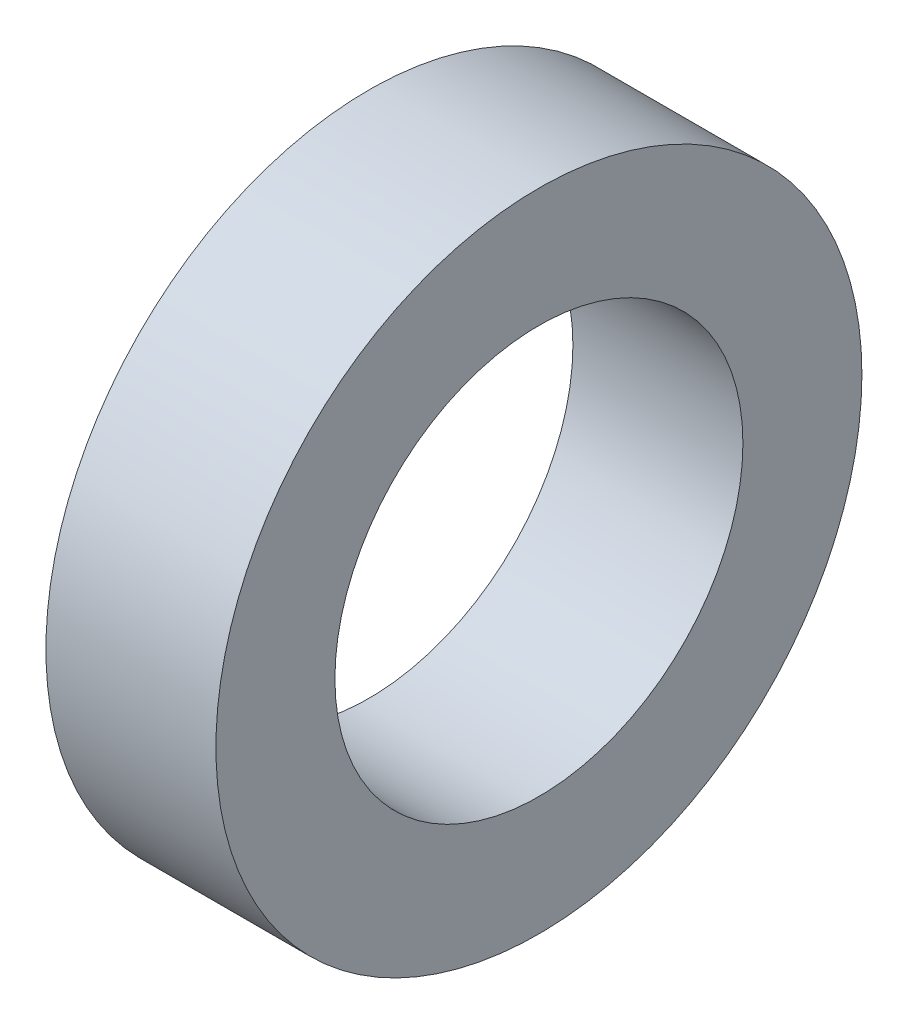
ISO-10303-21;
HEADER;
FILE_DESCRIPTION(('STEP AP214'),'2;1');
FILE_NAME('part.step','',(''),(''),'','','');
FILE_SCHEMA(('AUTOMOTIVE_DESIGN { 1 0 10303 214 1 1 1 1 }'));
ENDSEC;
DATA;
#1=APPLICATION_CONTEXT('core data for automotive mechanical design processes');
#2=APPLICATION_PROTOCOL_DEFINITION('international standard','automotive_design',2000,#1);
#3=PRODUCT_CONTEXT('',#1,'mechanical');
#4=PRODUCT('Part','Part','',(#3));
#5=PRODUCT_RELATED_PRODUCT_CATEGORY('part','',(#4));
#6=PRODUCT_DEFINITION_FORMATION('','',#4);
#7=PRODUCT_DEFINITION_CONTEXT('part definition',#1,'design');
#8=PRODUCT_DEFINITION('design','',#6,#7);
#9=PRODUCT_DEFINITION_SHAPE('','',#8);
#10=(LENGTH_UNIT() NAMED_UNIT(*) SI_UNIT(.MILLI.,.METRE.));
#11=(NAMED_UNIT(*) PLANE_ANGLE_UNIT() SI_UNIT($,.RADIAN.));
#12=(NAMED_UNIT(*) SI_UNIT($,.STERADIAN.) SOLID_ANGLE_UNIT());
#13=UNCERTAINTY_MEASURE_WITH_UNIT(LENGTH_MEASURE(1.E-05),#10,'distance_accuracy_value','');
#14=(GEOMETRIC_REPRESENTATION_CONTEXT(3) GLOBAL_UNCERTAINTY_ASSIGNED_CONTEXT((#13)) GLOBAL_UNIT_ASSIGNED_CONTEXT((#10,
#11,#12)) REPRESENTATION_CONTEXT('',''));
#15=CARTESIAN_POINT('',(0.,0.,0.));
#16=DIRECTION('',(0.,0.,1.));
#17=DIRECTION('',(1.,0.,0.));
#18=AXIS2_PLACEMENT_3D('',#15,#16,#17);
#19=CARTESIAN_POINT('',(5.,0.,0.));
#20=DIRECTION('',(1.,0.,0.));
#21=DIRECTION('',(0.,0.,-1.));
#22=AXIS2_PLACEMENT_3D('',#19,#20,#21);
#23=PLANE('',#22);
#24=CARTESIAN_POINT('',(5.,0.,0.));
#25=DIRECTION('',(1.,0.,0.));
#26=DIRECTION('',(0.,0.,-1.));
#27=AXIS2_PLACEMENT_3D('',#24,#25,#26);
#28=CIRCLE('',#27,6.);
#29=CARTESIAN_POINT('',(5.,0.,-6.));
#30=VERTEX_POINT('',#29);
#31=EDGE_CURVE('E27',#30,#30,#28,.F.);
#32=ORIENTED_EDGE('',*,*,#31,.T.);
#33=EDGE_LOOP('',(#32));
#34=FACE_BOUND('',#33,.T.);
#35=CARTESIAN_POINT('',(5.,0.,0.));
#36=DIRECTION('',(1.,0.,0.));
#37=DIRECTION('',(0.,0.,-1.));
#38=AXIS2_PLACEMENT_3D('',#35,#36,#37);
#39=CIRCLE('',#38,9.5);
#40=CARTESIAN_POINT('',(5.,0.,-9.5));
#41=VERTEX_POINT('',#40);
#42=EDGE_CURVE('E18',#41,#41,#39,.F.);
#43=ORIENTED_EDGE('',*,*,#42,.F.);
#44=EDGE_LOOP('',(#43));
#45=FACE_BOUND('',#44,.T.);
#46=ADVANCED_FACE('F15',(#34,#45),#23,.T.);
#47=CARTESIAN_POINT('',(0.,0.,0.));
#48=DIRECTION('',(1.,0.,0.));
#49=DIRECTION('',(0.,0.,-1.));
#50=AXIS2_PLACEMENT_3D('',#47,#48,#49);
#51=CYLINDRICAL_SURFACE('',#50,9.5);
#52=ORIENTED_EDGE('',*,*,#42,.T.);
#53=EDGE_LOOP('',(#52));
#54=FACE_BOUND('',#53,.T.);
#55=CARTESIAN_POINT('',(0.,0.,0.));
#56=DIRECTION('',(1.,0.,0.));
#57=DIRECTION('',(0.,0.,-1.));
#58=AXIS2_PLACEMENT_3D('',#55,#56,#57);
#59=CIRCLE('',#58,9.5);
#60=CARTESIAN_POINT('',(0.,0.,-9.5));
#61=VERTEX_POINT('',#60);
#62=EDGE_CURVE('E22',#61,#61,#59,.T.);
#63=ORIENTED_EDGE('',*,*,#62,.T.);
#64=EDGE_LOOP('',(#63));
#65=FACE_BOUND('',#64,.T.);
#66=ADVANCED_FACE('F35',(#54,#65),#51,.T.);
#67=CARTESIAN_POINT('',(0.,0.,0.));
#68=DIRECTION('',(1.,0.,0.));
#69=DIRECTION('',(0.,0.,-1.));
#70=AXIS2_PLACEMENT_3D('',#67,#68,#69);
#71=CYLINDRICAL_SURFACE('',#70,6.);
#72=ORIENTED_EDGE('',*,*,#31,.F.);
#73=EDGE_LOOP('',(#72));
#74=FACE_BOUND('',#73,.T.);
#75=CARTESIAN_POINT('',(0.,0.,0.));
#76=DIRECTION('',(1.,0.,0.));
#77=DIRECTION('',(0.,0.,-1.));
#78=AXIS2_PLACEMENT_3D('',#75,#76,#77);
#79=CIRCLE('',#78,6.);
#80=CARTESIAN_POINT('',(0.,0.,-6.));
#81=VERTEX_POINT('',#80);
#82=EDGE_CURVE('E10',#81,#81,#79,.F.);
#83=ORIENTED_EDGE('',*,*,#82,.T.);
#84=EDGE_LOOP('',(#83));
#85=FACE_BOUND('',#84,.T.);
#86=ADVANCED_FACE('F43',(#74,#85),#71,.F.);
#87=CARTESIAN_POINT('',(0.,0.,0.));
#88=DIRECTION('',(1.,0.,0.));
#89=DIRECTION('',(0.,0.,-1.));
#90=AXIS2_PLACEMENT_3D('',#87,#88,#89);
#91=PLANE('',#90);
#92=ORIENTED_EDGE('',*,*,#82,.F.);
#93=EDGE_LOOP('',(#92));
#94=FACE_BOUND('',#93,.T.);
#95=ORIENTED_EDGE('',*,*,#62,.F.);
#96=EDGE_LOOP('',(#95));
#97=FACE_BOUND('',#96,.T.);
#98=ADVANCED_FACE('F44',(#94,#97),#91,.F.);
#99=CLOSED_SHELL('',(#46,#66,#86,#98));
#100=MANIFOLD_SOLID_BREP('B1',#99);
#101=ADVANCED_BREP_SHAPE_REPRESENTATION('',(#18,#100),#14);
#102=SHAPE_DEFINITION_REPRESENTATION(#9,#101);
ENDSEC;
END-ISO-10303-21;
